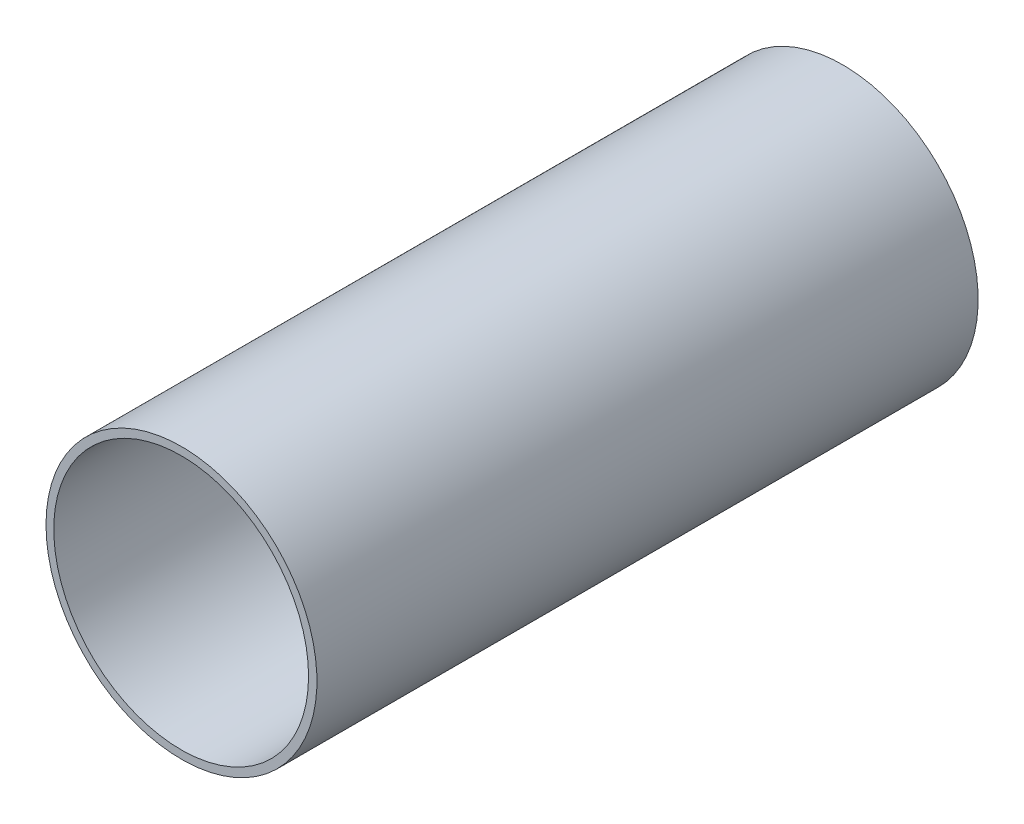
ISO-10303-21;
HEADER;
FILE_DESCRIPTION(('STEP AP214'),'2;1');
FILE_NAME('part.step','',(''),(''),'','','');
FILE_SCHEMA(('AUTOMOTIVE_DESIGN { 1 0 10303 214 1 1 1 1 }'));
ENDSEC;
DATA;
#1=APPLICATION_CONTEXT('core data for automotive mechanical design processes');
#2=APPLICATION_PROTOCOL_DEFINITION('international standard','automotive_design',2000,#1);
#3=PRODUCT_CONTEXT('',#1,'mechanical');
#4=PRODUCT('Part','Part','',(#3));
#5=PRODUCT_RELATED_PRODUCT_CATEGORY('part','',(#4));
#6=PRODUCT_DEFINITION_FORMATION('','',#4);
#7=PRODUCT_DEFINITION_CONTEXT('part definition',#1,'design');
#8=PRODUCT_DEFINITION('design','',#6,#7);
#9=PRODUCT_DEFINITION_SHAPE('','',#8);
#10=(LENGTH_UNIT() NAMED_UNIT(*) SI_UNIT(.MILLI.,.METRE.));
#11=(NAMED_UNIT(*) PLANE_ANGLE_UNIT() SI_UNIT($,.RADIAN.));
#12=(NAMED_UNIT(*) SI_UNIT($,.STERADIAN.) SOLID_ANGLE_UNIT());
#13=UNCERTAINTY_MEASURE_WITH_UNIT(LENGTH_MEASURE(1.E-05),#10,'distance_accuracy_value','');
#14=(GEOMETRIC_REPRESENTATION_CONTEXT(3) GLOBAL_UNCERTAINTY_ASSIGNED_CONTEXT((#13)) GLOBAL_UNIT_ASSIGNED_CONTEXT((#10,
#11,#12)) REPRESENTATION_CONTEXT('',''));
#15=CARTESIAN_POINT('',(0.,0.,0.));
#16=DIRECTION('',(0.,0.,1.));
#17=DIRECTION('',(1.,0.,0.));
#18=AXIS2_PLACEMENT_3D('',#15,#16,#17);
#19=CARTESIAN_POINT('',(-13.7052927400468,0.,205.));
#20=DIRECTION('',(0.,0.,-1.));
#21=DIRECTION('',(-1.,0.,0.));
#22=AXIS2_PLACEMENT_3D('',#19,#20,#21);
#23=CYLINDRICAL_SURFACE('',#22,42.);
#24=CARTESIAN_POINT('',(-13.7052927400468,0.,205.));
#25=DIRECTION('',(0.,0.,1.));
#26=DIRECTION('',(1.,0.,0.));
#27=AXIS2_PLACEMENT_3D('',#24,#25,#26);
#28=CIRCLE('',#27,42.);
#29=CARTESIAN_POINT('',(-55.7052927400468,0.,205.));
#30=VERTEX_POINT('',#29);
#31=EDGE_CURVE('E10',#30,#30,#28,.T.);
#32=CARTESIAN_POINT('',(-13.7052927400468,0.,0.));
#33=DIRECTION('',(0.,0.,1.));
#34=DIRECTION('',(1.,0.,0.));
#35=AXIS2_PLACEMENT_3D('',#32,#33,#34);
#36=CIRCLE('',#35,42.);
#37=CARTESIAN_POINT('',(-55.7052927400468,0.,0.));
#38=VERTEX_POINT('',#37);
#39=EDGE_CURVE('E34',#38,#38,#36,.T.);
#40=CARTESIAN_POINT('',(-55.7052927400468,0.,205.));
#41=CARTESIAN_POINT('',(-55.7052927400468,0.,202.864583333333));
#42=CARTESIAN_POINT('',(-55.7052927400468,0.,200.729166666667));
#43=CARTESIAN_POINT('',(-55.7052927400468,0.,196.458333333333));
#44=CARTESIAN_POINT('',(-55.7052927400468,0.,194.322916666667));
#45=CARTESIAN_POINT('',(-55.7052927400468,0.,190.052083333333));
#46=CARTESIAN_POINT('',(-55.7052927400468,0.,187.916666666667));
#47=CARTESIAN_POINT('',(-55.7052927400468,0.,183.645833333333));
#48=CARTESIAN_POINT('',(-55.7052927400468,0.,181.510416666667));
#49=CARTESIAN_POINT('',(-55.7052927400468,0.,177.239583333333));
#50=CARTESIAN_POINT('',(-55.7052927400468,0.,175.104166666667));
#51=CARTESIAN_POINT('',(-55.7052927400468,0.,170.833333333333));
#52=CARTESIAN_POINT('',(-55.7052927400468,0.,168.697916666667));
#53=CARTESIAN_POINT('',(-55.7052927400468,0.,164.427083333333));
#54=CARTESIAN_POINT('',(-55.7052927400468,0.,162.291666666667));
#55=CARTESIAN_POINT('',(-55.7052927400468,0.,158.020833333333));
#56=CARTESIAN_POINT('',(-55.7052927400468,0.,155.885416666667));
#57=CARTESIAN_POINT('',(-55.7052927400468,0.,151.614583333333));
#58=CARTESIAN_POINT('',(-55.7052927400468,0.,149.479166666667));
#59=CARTESIAN_POINT('',(-55.7052927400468,0.,145.208333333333));
#60=CARTESIAN_POINT('',(-55.7052927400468,0.,143.072916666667));
#61=CARTESIAN_POINT('',(-55.7052927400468,0.,138.802083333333));
#62=CARTESIAN_POINT('',(-55.7052927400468,0.,136.666666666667));
#63=CARTESIAN_POINT('',(-55.7052927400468,0.,132.395833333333));
#64=CARTESIAN_POINT('',(-55.7052927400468,0.,130.260416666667));
#65=CARTESIAN_POINT('',(-55.7052927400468,0.,125.989583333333));
#66=CARTESIAN_POINT('',(-55.7052927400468,0.,123.854166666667));
#67=CARTESIAN_POINT('',(-55.7052927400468,0.,119.583333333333));
#68=CARTESIAN_POINT('',(-55.7052927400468,0.,117.447916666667));
#69=CARTESIAN_POINT('',(-55.7052927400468,0.,113.177083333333));
#70=CARTESIAN_POINT('',(-55.7052927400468,0.,111.041666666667));
#71=CARTESIAN_POINT('',(-55.7052927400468,0.,106.770833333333));
#72=CARTESIAN_POINT('',(-55.7052927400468,0.,104.635416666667));
#73=CARTESIAN_POINT('',(-55.7052927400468,0.,100.364583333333));
#74=CARTESIAN_POINT('',(-55.7052927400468,0.,98.2291666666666));
#75=CARTESIAN_POINT('',(-55.7052927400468,0.,93.9583333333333));
#76=CARTESIAN_POINT('',(-55.7052927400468,0.,91.8229166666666));
#77=CARTESIAN_POINT('',(-55.7052927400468,0.,87.5520833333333));
#78=CARTESIAN_POINT('',(-55.7052927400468,0.,85.4166666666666));
#79=CARTESIAN_POINT('',(-55.7052927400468,0.,81.1458333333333));
#80=CARTESIAN_POINT('',(-55.7052927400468,0.,79.0104166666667));
#81=CARTESIAN_POINT('',(-55.7052927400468,0.,74.7395833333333));
#82=CARTESIAN_POINT('',(-55.7052927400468,0.,72.6041666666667));
#83=CARTESIAN_POINT('',(-55.7052927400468,0.,68.3333333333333));
#84=CARTESIAN_POINT('',(-55.7052927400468,0.,66.1979166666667));
#85=CARTESIAN_POINT('',(-55.7052927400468,0.,61.9270833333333));
#86=CARTESIAN_POINT('',(-55.7052927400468,0.,59.7916666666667));
#87=CARTESIAN_POINT('',(-55.7052927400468,0.,55.5208333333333));
#88=CARTESIAN_POINT('',(-55.7052927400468,0.,53.3854166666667));
#89=CARTESIAN_POINT('',(-55.7052927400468,0.,49.1145833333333));
#90=CARTESIAN_POINT('',(-55.7052927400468,0.,46.9791666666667));
#91=CARTESIAN_POINT('',(-55.7052927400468,0.,42.7083333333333));
#92=CARTESIAN_POINT('',(-55.7052927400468,0.,40.5729166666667));
#93=CARTESIAN_POINT('',(-55.7052927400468,0.,36.3020833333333));
#94=CARTESIAN_POINT('',(-55.7052927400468,0.,34.1666666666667));
#95=CARTESIAN_POINT('',(-55.7052927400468,0.,29.8958333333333));
#96=CARTESIAN_POINT('',(-55.7052927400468,0.,27.7604166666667));
#97=CARTESIAN_POINT('',(-55.7052927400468,0.,23.4895833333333));
#98=CARTESIAN_POINT('',(-55.7052927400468,0.,21.3541666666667));
#99=CARTESIAN_POINT('',(-55.7052927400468,0.,17.0833333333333));
#100=CARTESIAN_POINT('',(-55.7052927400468,0.,14.9479166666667));
#101=CARTESIAN_POINT('',(-55.7052927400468,0.,10.6770833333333));
#102=CARTESIAN_POINT('',(-55.7052927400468,0.,8.54166666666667));
#103=CARTESIAN_POINT('',(-55.7052927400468,0.,4.27083333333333));
#104=CARTESIAN_POINT('',(-55.7052927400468,0.,2.13541666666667));
#105=CARTESIAN_POINT('',(-55.7052927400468,0.,0.));
#106=B_SPLINE_CURVE_WITH_KNOTS('',3,(#40,#41,#42,#43,#44,#45,#46,#47,#48,#49,#50,#51,#52,#53,
#54,#55,#56,#57,#58,#59,#60,#61,#62,#63,#64,#65,#66,#67,#68,#69,#70,#71,#72,#73,#74,#75,#76,#77,
#78,#79,#80,#81,#82,#83,#84,#85,#86,#87,#88,#89,#90,#91,#92,#93,#94,#95,#96,#97,#98,#99,#100,
#101,#102,#103,#104,#105),.UNSPECIFIED.,.F.,.F.,(4,2,2,2,2,2,2,2,2,2,2,2,2,2,2,2,2,2,2,2,2,2,2,
2,2,2,2,2,2,2,2,2,4),(0.,6.40625,12.8125,19.21875,25.625,32.03125,38.4375,44.84375,51.25,
57.65625,64.0625,70.46875,76.875,83.28125,89.6875,96.09375,102.5,108.90625,115.3125,121.71875,
128.125,134.53125,140.9375,147.34375,153.75,160.15625,166.5625,172.96875,179.375,185.78125,
192.1875,198.59375,205.),.UNSPECIFIED.);
#107=EDGE_CURVE('BSEAM31',#30,#38,#106,.T.);
#108=ORIENTED_EDGE('',*,*,#31,.F.);
#109=ORIENTED_EDGE('',*,*,#39,.T.);
#110=ORIENTED_EDGE('',*,*,#107,.T.);
#111=ORIENTED_EDGE('',*,*,#107,.F.);
#112=EDGE_LOOP('',(#108,#110,#109,#111));
#113=FACE_BOUND('',#112,.T.);
#114=ADVANCED_FACE('F31',(#113),#23,.T.);
#115=CARTESIAN_POINT('',(-13.7052927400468,0.,205.));
#116=DIRECTION('',(0.,0.,1.));
#117=DIRECTION('',(1.,0.,0.));
#118=AXIS2_PLACEMENT_3D('',#115,#116,#117);
#119=PLANE('',#118);
#120=CARTESIAN_POINT('',(-13.8008042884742,0.,205.));
#121=DIRECTION('',(0.,0.,1.));
#122=DIRECTION('',(1.,0.,0.));
#123=AXIS2_PLACEMENT_3D('',#120,#121,#122);
#124=CIRCLE('',#123,39.5);
#125=CARTESIAN_POINT('',(25.6991957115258,0.,205.));
#126=VERTEX_POINT('',#125);
#127=EDGE_CURVE('E41',#126,#126,#124,.T.);
#128=ORIENTED_EDGE('',*,*,#127,.F.);
#129=EDGE_LOOP('',(#128));
#130=FACE_BOUND('',#129,.T.);
#131=ORIENTED_EDGE('',*,*,#31,.T.);
#132=EDGE_LOOP('',(#131));
#133=FACE_BOUND('',#132,.T.);
#134=ADVANCED_FACE('F59',(#130,#133),#119,.T.);
#135=CARTESIAN_POINT('',(-13.7052927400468,0.,0.));
#136=DIRECTION('',(0.,0.,1.));
#137=DIRECTION('',(1.,0.,0.));
#138=AXIS2_PLACEMENT_3D('',#135,#136,#137);
#139=PLANE('',#138);
#140=CARTESIAN_POINT('',(-13.8008042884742,0.,0.));
#141=DIRECTION('',(0.,0.,1.));
#142=DIRECTION('',(1.,0.,0.));
#143=AXIS2_PLACEMENT_3D('',#140,#141,#142);
#144=CIRCLE('',#143,39.5);
#145=CARTESIAN_POINT('',(25.6991957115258,0.,0.));
#146=VERTEX_POINT('',#145);
#147=EDGE_CURVE('E45',#146,#146,#144,.T.);
#148=ORIENTED_EDGE('',*,*,#147,.T.);
#149=EDGE_LOOP('',(#148));
#150=FACE_BOUND('',#149,.T.);
#151=ORIENTED_EDGE('',*,*,#39,.F.);
#152=EDGE_LOOP('',(#151));
#153=FACE_BOUND('',#152,.T.);
#154=ADVANCED_FACE('F49',(#150,#153),#139,.F.);
#155=CARTESIAN_POINT('',(-13.8008042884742,0.,0.));
#156=DIRECTION('',(0.,0.,1.));
#157=DIRECTION('',(1.,0.,0.));
#158=AXIS2_PLACEMENT_3D('',#155,#156,#157);
#159=CYLINDRICAL_SURFACE('',#158,39.5);
#160=CARTESIAN_POINT('',(25.6991957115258,0.,205.));
#161=CARTESIAN_POINT('',(25.6991957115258,0.,202.864583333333));
#162=CARTESIAN_POINT('',(25.6991957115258,0.,200.729166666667));
#163=CARTESIAN_POINT('',(25.6991957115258,0.,196.458333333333));
#164=CARTESIAN_POINT('',(25.6991957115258,0.,194.322916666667));
#165=CARTESIAN_POINT('',(25.6991957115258,0.,190.052083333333));
#166=CARTESIAN_POINT('',(25.6991957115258,0.,187.916666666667));
#167=CARTESIAN_POINT('',(25.6991957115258,0.,183.645833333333));
#168=CARTESIAN_POINT('',(25.6991957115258,0.,181.510416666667));
#169=CARTESIAN_POINT('',(25.6991957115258,0.,177.239583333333));
#170=CARTESIAN_POINT('',(25.6991957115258,0.,175.104166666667));
#171=CARTESIAN_POINT('',(25.6991957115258,0.,170.833333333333));
#172=CARTESIAN_POINT('',(25.6991957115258,0.,168.697916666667));
#173=CARTESIAN_POINT('',(25.6991957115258,0.,164.427083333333));
#174=CARTESIAN_POINT('',(25.6991957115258,0.,162.291666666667));
#175=CARTESIAN_POINT('',(25.6991957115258,0.,158.020833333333));
#176=CARTESIAN_POINT('',(25.6991957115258,0.,155.885416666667));
#177=CARTESIAN_POINT('',(25.6991957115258,0.,151.614583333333));
#178=CARTESIAN_POINT('',(25.6991957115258,0.,149.479166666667));
#179=CARTESIAN_POINT('',(25.6991957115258,0.,145.208333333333));
#180=CARTESIAN_POINT('',(25.6991957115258,0.,143.072916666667));
#181=CARTESIAN_POINT('',(25.6991957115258,0.,138.802083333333));
#182=CARTESIAN_POINT('',(25.6991957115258,0.,136.666666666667));
#183=CARTESIAN_POINT('',(25.6991957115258,0.,132.395833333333));
#184=CARTESIAN_POINT('',(25.6991957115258,0.,130.260416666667));
#185=CARTESIAN_POINT('',(25.6991957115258,0.,125.989583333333));
#186=CARTESIAN_POINT('',(25.6991957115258,0.,123.854166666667));
#187=CARTESIAN_POINT('',(25.6991957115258,0.,119.583333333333));
#188=CARTESIAN_POINT('',(25.6991957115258,0.,117.447916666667));
#189=CARTESIAN_POINT('',(25.6991957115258,0.,113.177083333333));
#190=CARTESIAN_POINT('',(25.6991957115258,0.,111.041666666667));
#191=CARTESIAN_POINT('',(25.6991957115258,0.,106.770833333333));
#192=CARTESIAN_POINT('',(25.6991957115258,0.,104.635416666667));
#193=CARTESIAN_POINT('',(25.6991957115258,0.,100.364583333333));
#194=CARTESIAN_POINT('',(25.6991957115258,0.,98.2291666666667));
#195=CARTESIAN_POINT('',(25.6991957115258,0.,93.9583333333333));
#196=CARTESIAN_POINT('',(25.6991957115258,0.,91.8229166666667));
#197=CARTESIAN_POINT('',(25.6991957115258,0.,87.5520833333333));
#198=CARTESIAN_POINT('',(25.6991957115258,0.,85.4166666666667));
#199=CARTESIAN_POINT('',(25.6991957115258,0.,81.1458333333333));
#200=CARTESIAN_POINT('',(25.6991957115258,0.,79.0104166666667));
#201=CARTESIAN_POINT('',(25.6991957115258,0.,74.7395833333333));
#202=CARTESIAN_POINT('',(25.6991957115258,0.,72.6041666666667));
#203=CARTESIAN_POINT('',(25.6991957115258,0.,68.3333333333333));
#204=CARTESIAN_POINT('',(25.6991957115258,0.,66.1979166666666));
#205=CARTESIAN_POINT('',(25.6991957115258,0.,61.9270833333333));
#206=CARTESIAN_POINT('',(25.6991957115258,0.,59.7916666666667));
#207=CARTESIAN_POINT('',(25.6991957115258,0.,55.5208333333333));
#208=CARTESIAN_POINT('',(25.6991957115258,0.,53.3854166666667));
#209=CARTESIAN_POINT('',(25.6991957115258,0.,49.1145833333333));
#210=CARTESIAN_POINT('',(25.6991957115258,0.,46.9791666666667));
#211=CARTESIAN_POINT('',(25.6991957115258,0.,42.7083333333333));
#212=CARTESIAN_POINT('',(25.6991957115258,0.,40.5729166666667));
#213=CARTESIAN_POINT('',(25.6991957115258,0.,36.3020833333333));
#214=CARTESIAN_POINT('',(25.6991957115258,0.,34.1666666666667));
#215=CARTESIAN_POINT('',(25.6991957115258,0.,29.8958333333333));
#216=CARTESIAN_POINT('',(25.6991957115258,0.,27.7604166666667));
#217=CARTESIAN_POINT('',(25.6991957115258,0.,23.4895833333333));
#218=CARTESIAN_POINT('',(25.6991957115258,0.,21.3541666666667));
#219=CARTESIAN_POINT('',(25.6991957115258,0.,17.0833333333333));
#220=CARTESIAN_POINT('',(25.6991957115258,0.,14.9479166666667));
#221=CARTESIAN_POINT('',(25.6991957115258,0.,10.6770833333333));
#222=CARTESIAN_POINT('',(25.6991957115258,0.,8.54166666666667));
#223=CARTESIAN_POINT('',(25.6991957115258,0.,4.27083333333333));
#224=CARTESIAN_POINT('',(25.6991957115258,0.,2.13541666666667));
#225=CARTESIAN_POINT('',(25.6991957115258,0.,0.));
#226=B_SPLINE_CURVE_WITH_KNOTS('',3,(#160,#161,#162,#163,#164,#165,#166,#167,#168,#169,#170,
#171,#172,#173,#174,#175,#176,#177,#178,#179,#180,#181,#182,#183,#184,#185,#186,#187,#188,#189,
#190,#191,#192,#193,#194,#195,#196,#197,#198,#199,#200,#201,#202,#203,#204,#205,#206,#207,#208,
#209,#210,#211,#212,#213,#214,#215,#216,#217,#218,#219,#220,#221,#222,#223,#224,#225),
.UNSPECIFIED.,.F.,.F.,(4,2,2,2,2,2,2,2,2,2,2,2,2,2,2,2,2,2,2,2,2,2,2,2,2,2,2,2,2,2,2,2,4),(0.,
6.40625,12.8125,19.21875,25.625,32.03125,38.4375,44.84375,51.25,57.65625,64.0625,70.46875,
76.875,83.28125,89.6875,96.09375,102.5,108.90625,115.3125,121.71875,128.125,134.53125,140.9375,
147.34375,153.75,160.15625,166.5625,172.96875,179.375,185.78125,192.1875,198.59375,205.),.UNSPECIFIED.);
#227=EDGE_CURVE('BSEAM52',#126,#146,#226,.T.);
#228=ORIENTED_EDGE('',*,*,#127,.T.);
#229=ORIENTED_EDGE('',*,*,#147,.F.);
#230=ORIENTED_EDGE('',*,*,#227,.T.);
#231=ORIENTED_EDGE('',*,*,#227,.F.);
#232=EDGE_LOOP('',(#228,#230,#229,#231));
#233=FACE_BOUND('',#232,.T.);
#234=ADVANCED_FACE('F52',(#233),#159,.F.);
#235=CLOSED_SHELL('',(#114,#134,#154,#234));
#236=MANIFOLD_SOLID_BREP('B2',#235);
#237=ADVANCED_BREP_SHAPE_REPRESENTATION('',(#18,#236),#14);
#238=SHAPE_DEFINITION_REPRESENTATION(#9,#237);
ENDSEC;
END-ISO-10303-21;
